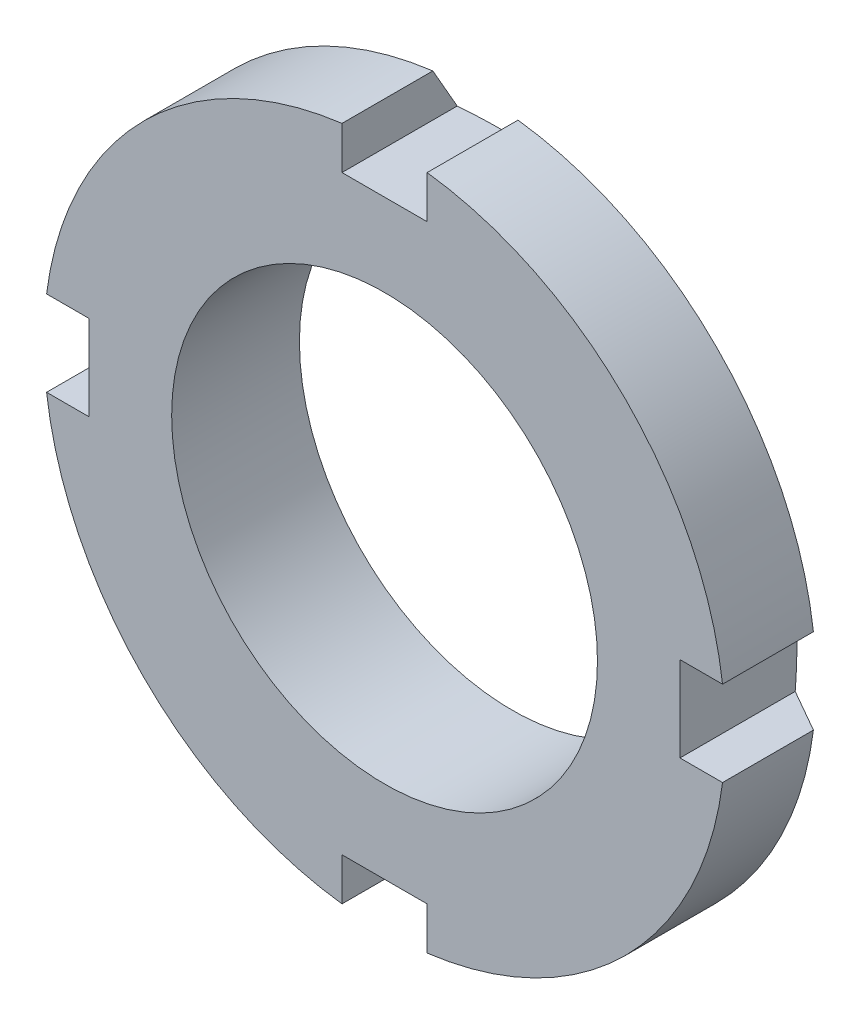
from build123d import *

# Parameters (mm, degrees)
ESQUISSE2_OUTSIDE_W     = 43.13
ESQUISSE2_OUTSIDE_H     = 43.13
ENL_V_MAT_EXTRU_2_DEPTH = 24.409399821


with BuildPart() as part:
    # Esquisse1 → Base-R_volution (revolve)
    with BuildSketch(Plane(origin=(0, 0, 0), x_dir=(0, 0, -1), z_dir=(1, 0, 0)), mode=Mode.PRIVATE) as base_r_volution_sk:
        Polygon((0, 10), (0, 13), (-1.732050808, 16), (-6, 16), (-6, 10), align=None)
    revolve(base_r_volution_sk.sketch.rotate(Axis((0, 0, 0), (0, 0, 1)), 90), axis=Axis((0, 0, 0), (0, 0, 1)))

    # Esquisse2 outside → Enl_v. mat.-Extru.2 (cut, through all)
    with BuildSketch(Plane.XY):
        Rectangle(ESQUISSE2_OUTSIDE_W, ESQUISSE2_OUTSIDE_H)
        with BuildLine():
            Line((-2, 13.874507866), (2, 13.874507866))
            Line((2, 13.874507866), (2, 15.874507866))
            ThreePointArc((2, 15.874507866), (11.313708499, 11.313708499), (15.874507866, 2))
            Line((15.874507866, 2), (13.874507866, 2))
            Line((13.874507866, 2), (13.874507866, -2))
            Line((13.874507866, -2), (15.874507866, -2))
            ThreePointArc((15.874507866, -2), (11.313708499, -11.313708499), (2, -15.874507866))
            Line((2, -15.874507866), (2, -13.874507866))
            Line((2, -13.874507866), (-2, -13.874507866))
            Line((-2, -13.874507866), (-2, -15.874507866))
            ThreePointArc((-2, -15.874507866), (-11.313708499, -11.313708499), (-15.874507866, -2))
            Line((-15.874507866, -2), (-13.874507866, -2))
            Line((-13.874507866, -2), (-13.874507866, 2))
            Line((-13.874507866, 2), (-15.874507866, 2))
            ThreePointArc((-15.874507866, 2), (-11.313708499, 11.313708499), (-2, 15.874507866))
            Line((-2, 15.874507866), (-2, 13.874507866))
        make_face(mode=Mode.SUBTRACT)
    extrude(amount=ENL_V_MAT_EXTRU_2_DEPTH, mode=Mode.SUBTRACT)


solid = part.part
